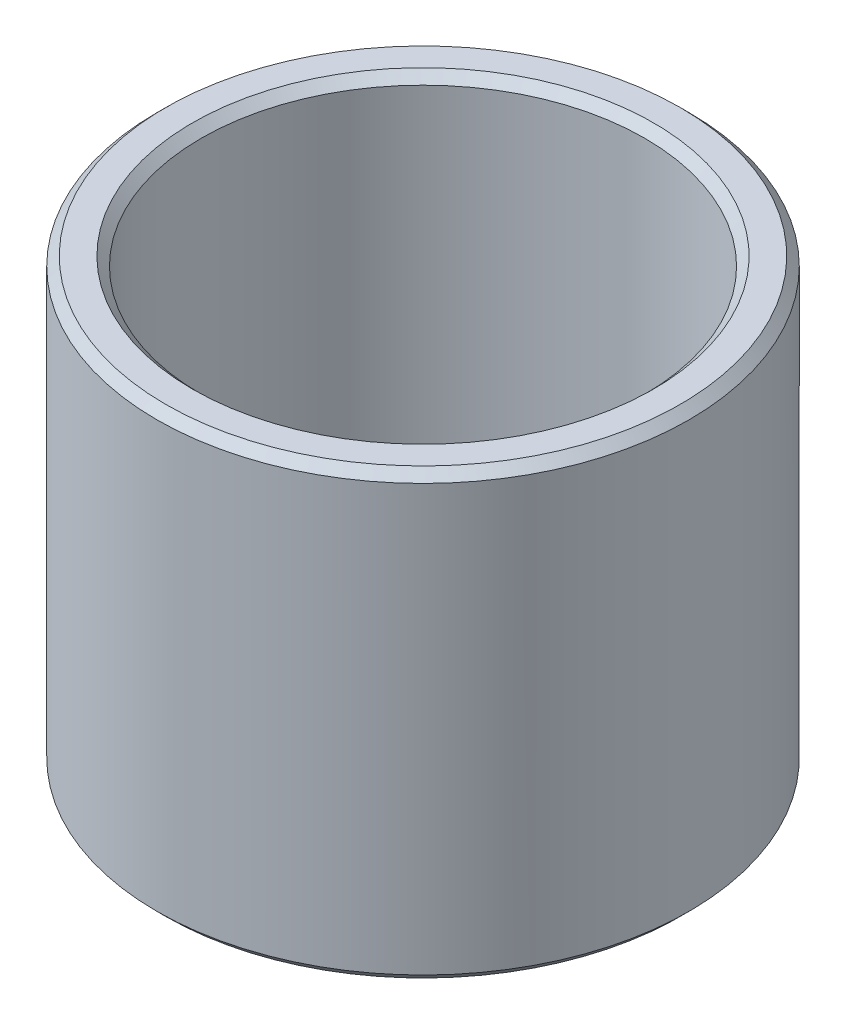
ISO-10303-21;
HEADER;
FILE_DESCRIPTION(('STEP AP214'),'2;1');
FILE_NAME('part.step','',(''),(''),'','','');
FILE_SCHEMA(('AUTOMOTIVE_DESIGN { 1 0 10303 214 1 1 1 1 }'));
ENDSEC;
DATA;
#1=APPLICATION_CONTEXT('core data for automotive mechanical design processes');
#2=APPLICATION_PROTOCOL_DEFINITION('international standard','automotive_design',2000,#1);
#3=PRODUCT_CONTEXT('',#1,'mechanical');
#4=PRODUCT('Part','Part','',(#3));
#5=PRODUCT_RELATED_PRODUCT_CATEGORY('part','',(#4));
#6=PRODUCT_DEFINITION_FORMATION('','',#4);
#7=PRODUCT_DEFINITION_CONTEXT('part definition',#1,'design');
#8=PRODUCT_DEFINITION('design','',#6,#7);
#9=PRODUCT_DEFINITION_SHAPE('','',#8);
#10=(LENGTH_UNIT() NAMED_UNIT(*) SI_UNIT(.MILLI.,.METRE.));
#11=(NAMED_UNIT(*) PLANE_ANGLE_UNIT() SI_UNIT($,.RADIAN.));
#12=(NAMED_UNIT(*) SI_UNIT($,.STERADIAN.) SOLID_ANGLE_UNIT());
#13=UNCERTAINTY_MEASURE_WITH_UNIT(LENGTH_MEASURE(1.E-05),#10,'distance_accuracy_value','');
#14=(GEOMETRIC_REPRESENTATION_CONTEXT(3) GLOBAL_UNCERTAINTY_ASSIGNED_CONTEXT((#13)) GLOBAL_UNIT_ASSIGNED_CONTEXT((#10,
#11,#12)) REPRESENTATION_CONTEXT('',''));
#15=CARTESIAN_POINT('',(0.,0.,0.));
#16=DIRECTION('',(0.,0.,1.));
#17=DIRECTION('',(1.,0.,0.));
#18=AXIS2_PLACEMENT_3D('',#15,#16,#17);
#19=CARTESIAN_POINT('',(0.,0.,0.));
#20=DIRECTION('',(0.,1.,0.));
#21=DIRECTION('',(0.,0.,1.));
#22=AXIS2_PLACEMENT_3D('',#19,#20,#21);
#23=CYLINDRICAL_SURFACE('',#22,5.);
#24=CARTESIAN_POINT('',(0.,9.80000000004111,0.));
#25=DIRECTION('',(0.,1.,0.));
#26=DIRECTION('',(0.,0.,1.));
#27=AXIS2_PLACEMENT_3D('',#24,#25,#26);
#28=CIRCLE('',#27,5.0000000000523);
#29=CARTESIAN_POINT('',(0.,9.80000000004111,5.0000000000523));
#30=VERTEX_POINT('',#29);
#31=EDGE_CURVE('E33',#30,#30,#28,.T.);
#32=ORIENTED_EDGE('',*,*,#31,.T.);
#33=EDGE_LOOP('',(#32));
#34=FACE_BOUND('',#33,.T.);
#35=CARTESIAN_POINT('',(0.,0.200000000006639,0.));
#36=DIRECTION('',(0.,-1.,0.));
#37=DIRECTION('',(0.,0.,-1.));
#38=AXIS2_PLACEMENT_3D('',#35,#36,#37);
#39=CIRCLE('',#38,4.99999999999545);
#40=CARTESIAN_POINT('',(0.,0.200000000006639,-4.99999999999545));
#41=VERTEX_POINT('',#40);
#42=EDGE_CURVE('E36',#41,#41,#39,.T.);
#43=ORIENTED_EDGE('',*,*,#42,.T.);
#44=EDGE_LOOP('',(#43));
#45=FACE_BOUND('',#44,.T.);
#46=ADVANCED_FACE('F14',(#34,#45),#23,.F.);
#47=CARTESIAN_POINT('',(0.,0.,0.));
#48=DIRECTION('',(0.,-1.,0.));
#49=DIRECTION('',(0.,0.,-1.));
#50=AXIS2_PLACEMENT_3D('',#47,#48,#49);
#51=CONICAL_SURFACE('',#50,5.20000000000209,0.785398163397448);
#52=ORIENTED_EDGE('',*,*,#42,.F.);
#53=EDGE_LOOP('',(#52));
#54=FACE_BOUND('',#53,.T.);
#55=CARTESIAN_POINT('',(0.,0.,0.));
#56=DIRECTION('',(0.,-1.,0.));
#57=DIRECTION('',(0.,0.,-1.));
#58=AXIS2_PLACEMENT_3D('',#55,#56,#57);
#59=CIRCLE('',#58,5.20000000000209);
#60=CARTESIAN_POINT('',(0.,0.,-5.20000000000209));
#61=VERTEX_POINT('',#60);
#62=EDGE_CURVE('E17',#61,#61,#59,.T.);
#63=ORIENTED_EDGE('',*,*,#62,.T.);
#64=EDGE_LOOP('',(#63));
#65=FACE_BOUND('',#64,.T.);
#66=ADVANCED_FACE('F54',(#54,#65),#51,.F.);
#67=CARTESIAN_POINT('',(0.,10.0000000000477,0.));
#68=DIRECTION('',(0.,1.,0.));
#69=DIRECTION('',(0.,0.,1.));
#70=AXIS2_PLACEMENT_3D('',#67,#68,#69);
#71=CONICAL_SURFACE('',#70,5.20000000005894,0.785398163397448);
#72=CARTESIAN_POINT('',(0.,9.99999999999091,0.));
#73=DIRECTION('',(0.,1.,0.));
#74=DIRECTION('',(0.,0.,1.));
#75=AXIS2_PLACEMENT_3D('',#72,#73,#74);
#76=CIRCLE('',#75,5.20000000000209);
#77=CARTESIAN_POINT('',(0.,9.99999999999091,5.20000000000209));
#78=VERTEX_POINT('',#77);
#79=EDGE_CURVE('E47',#78,#78,#76,.T.);
#80=ORIENTED_EDGE('',*,*,#79,.T.);
#81=EDGE_LOOP('',(#80));
#82=FACE_BOUND('',#81,.T.);
#83=ORIENTED_EDGE('',*,*,#31,.F.);
#84=EDGE_LOOP('',(#83));
#85=FACE_BOUND('',#84,.T.);
#86=ADVANCED_FACE('F59',(#82,#85),#71,.F.);
#87=CARTESIAN_POINT('',(5.8,0.,0.));
#88=DIRECTION('',(0.,1.,0.));
#89=DIRECTION('',(0.,0.,1.));
#90=AXIS2_PLACEMENT_3D('',#87,#88,#89);
#91=PLANE('',#90);
#92=CARTESIAN_POINT('',(0.,5.6843418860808E-11,0.));
#93=DIRECTION('',(0.,1.,0.));
#94=DIRECTION('',(0.,0.,1.));
#95=AXIS2_PLACEMENT_3D('',#92,#93,#94);
#96=CIRCLE('',#95,5.80000000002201);
#97=CARTESIAN_POINT('',(0.,5.6843418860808E-11,5.80000000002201));
#98=VERTEX_POINT('',#97);
#99=EDGE_CURVE('E45',#98,#98,#96,.T.);
#100=ORIENTED_EDGE('',*,*,#99,.F.);
#101=EDGE_LOOP('',(#100));
#102=FACE_BOUND('',#101,.T.);
#103=ORIENTED_EDGE('',*,*,#62,.F.);
#104=EDGE_LOOP('',(#103));
#105=FACE_BOUND('',#104,.T.);
#106=ADVANCED_FACE('F56',(#102,#105),#91,.F.);
#107=CARTESIAN_POINT('',(0.,10.,0.));
#108=DIRECTION('',(0.,-1.,0.));
#109=DIRECTION('',(0.,0.,-1.));
#110=AXIS2_PLACEMENT_3D('',#107,#108,#109);
#111=PLANE('',#110);
#112=ORIENTED_EDGE('',*,*,#79,.F.);
#113=EDGE_LOOP('',(#112));
#114=FACE_BOUND('',#113,.T.);
#115=CARTESIAN_POINT('',(0.,9.99999999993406,0.));
#116=DIRECTION('',(0.,-1.,0.));
#117=DIRECTION('',(0.,0.,-1.));
#118=AXIS2_PLACEMENT_3D('',#115,#116,#117);
#119=CIRCLE('',#118,5.79999999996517);
#120=CARTESIAN_POINT('',(0.,9.99999999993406,-5.79999999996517));
#121=VERTEX_POINT('',#120);
#122=EDGE_CURVE('E26',#121,#121,#119,.T.);
#123=ORIENTED_EDGE('',*,*,#122,.F.);
#124=EDGE_LOOP('',(#123));
#125=FACE_BOUND('',#124,.T.);
#126=ADVANCED_FACE('F58',(#114,#125),#111,.F.);
#127=CARTESIAN_POINT('',(0.,0.200000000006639,0.));
#128=DIRECTION('',(0.,1.,0.));
#129=DIRECTION('',(0.,0.,1.));
#130=AXIS2_PLACEMENT_3D('',#127,#128,#129);
#131=CONICAL_SURFACE('',#130,5.99999999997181,0.785398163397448);
#132=CARTESIAN_POINT('',(0.,0.199999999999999,0.));
#133=DIRECTION('',(0.,1.,0.));
#134=DIRECTION('',(0.,0.,1.));
#135=AXIS2_PLACEMENT_3D('',#132,#133,#134);
#136=CIRCLE('',#135,6.);
#137=CARTESIAN_POINT('',(0.,0.199999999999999,6.));
#138=VERTEX_POINT('',#137);
#139=EDGE_CURVE('E21',#138,#138,#136,.T.);
#140=ORIENTED_EDGE('',*,*,#139,.F.);
#141=EDGE_LOOP('',(#140));
#142=FACE_BOUND('',#141,.T.);
#143=ORIENTED_EDGE('',*,*,#99,.T.);
#144=EDGE_LOOP('',(#143));
#145=FACE_BOUND('',#144,.T.);
#146=ADVANCED_FACE('F67',(#142,#145),#131,.T.);
#147=CARTESIAN_POINT('',(0.,9.80000000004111,0.));
#148=DIRECTION('',(0.,-1.,0.));
#149=DIRECTION('',(0.,0.,-1.));
#150=AXIS2_PLACEMENT_3D('',#147,#148,#149);
#151=CONICAL_SURFACE('',#150,5.99999999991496,0.785398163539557);
#152=ORIENTED_EDGE('',*,*,#122,.T.);
#153=EDGE_LOOP('',(#152));
#154=FACE_BOUND('',#153,.T.);
#155=CARTESIAN_POINT('',(0.,9.8,0.));
#156=DIRECTION('',(0.,1.,0.));
#157=DIRECTION('',(0.,0.,1.));
#158=AXIS2_PLACEMENT_3D('',#155,#156,#157);
#159=CIRCLE('',#158,6.);
#160=CARTESIAN_POINT('',(0.,9.8,6.));
#161=VERTEX_POINT('',#160);
#162=EDGE_CURVE('E10',#161,#161,#159,.F.);
#163=ORIENTED_EDGE('',*,*,#162,.F.);
#164=EDGE_LOOP('',(#163));
#165=FACE_BOUND('',#164,.T.);
#166=ADVANCED_FACE('F74',(#154,#165),#151,.T.);
#167=CARTESIAN_POINT('',(0.,0.,0.));
#168=DIRECTION('',(0.,1.,0.));
#169=DIRECTION('',(0.,0.,1.));
#170=AXIS2_PLACEMENT_3D('',#167,#168,#169);
#171=CYLINDRICAL_SURFACE('',#170,6.);
#172=ORIENTED_EDGE('',*,*,#162,.T.);
#173=EDGE_LOOP('',(#172));
#174=FACE_BOUND('',#173,.T.);
#175=ORIENTED_EDGE('',*,*,#139,.T.);
#176=EDGE_LOOP('',(#175));
#177=FACE_BOUND('',#176,.T.);
#178=ADVANCED_FACE('F72',(#174,#177),#171,.T.);
#179=CLOSED_SHELL('',(#46,#66,#86,#106,#126,#146,#166,#178));
#180=MANIFOLD_SOLID_BREP('B1',#179);
#181=ADVANCED_BREP_SHAPE_REPRESENTATION('',(#18,#180),#14);
#182=SHAPE_DEFINITION_REPRESENTATION(#9,#181);
ENDSEC;
END-ISO-10303-21;
